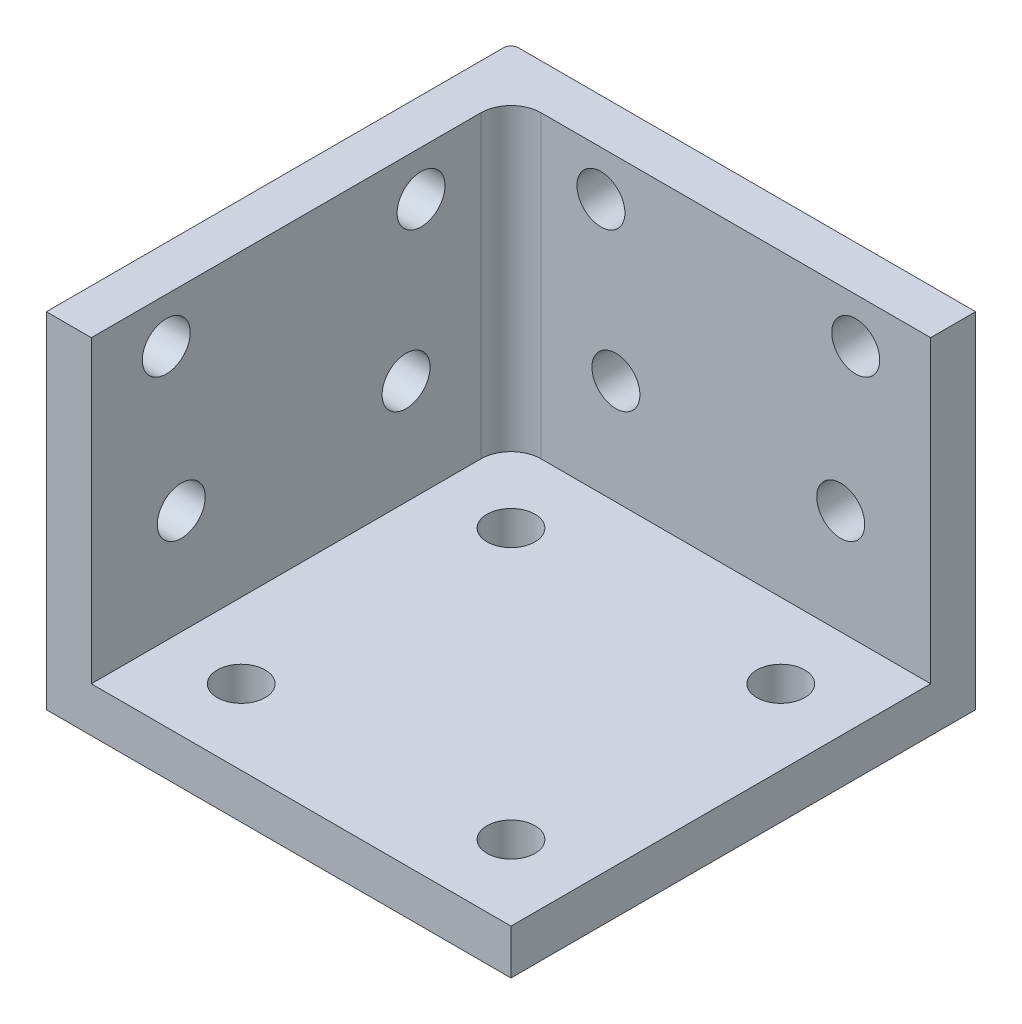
ISO-10303-21;
HEADER;
FILE_DESCRIPTION(('STEP AP214'),'2;1');
FILE_NAME('part.step','',(''),(''),'','','');
FILE_SCHEMA(('AUTOMOTIVE_DESIGN { 1 0 10303 214 1 1 1 1 }'));
ENDSEC;
DATA;
#1=APPLICATION_CONTEXT('core data for automotive mechanical design processes');
#2=APPLICATION_PROTOCOL_DEFINITION('international standard','automotive_design',2000,#1);
#3=PRODUCT_CONTEXT('',#1,'mechanical');
#4=PRODUCT('Part','Part','',(#3));
#5=PRODUCT_RELATED_PRODUCT_CATEGORY('part','',(#4));
#6=PRODUCT_DEFINITION_FORMATION('','',#4);
#7=PRODUCT_DEFINITION_CONTEXT('part definition',#1,'design');
#8=PRODUCT_DEFINITION('design','',#6,#7);
#9=PRODUCT_DEFINITION_SHAPE('','',#8);
#10=(LENGTH_UNIT() NAMED_UNIT(*) SI_UNIT(.MILLI.,.METRE.));
#11=(NAMED_UNIT(*) PLANE_ANGLE_UNIT() SI_UNIT($,.RADIAN.));
#12=(NAMED_UNIT(*) SI_UNIT($,.STERADIAN.) SOLID_ANGLE_UNIT());
#13=UNCERTAINTY_MEASURE_WITH_UNIT(LENGTH_MEASURE(1.E-05),#10,'distance_accuracy_value','');
#14=(GEOMETRIC_REPRESENTATION_CONTEXT(3) GLOBAL_UNCERTAINTY_ASSIGNED_CONTEXT((#13)) GLOBAL_UNIT_ASSIGNED_CONTEXT((#10,
#11,#12)) REPRESENTATION_CONTEXT('',''));
#15=CARTESIAN_POINT('',(0.,0.,0.));
#16=DIRECTION('',(0.,0.,1.));
#17=DIRECTION('',(1.,0.,0.));
#18=AXIS2_PLACEMENT_3D('',#15,#16,#17);
#19=CARTESIAN_POINT('',(0.,0.,28.));
#20=DIRECTION('',(0.,1.,0.));
#21=DIRECTION('',(0.,0.,1.));
#22=AXIS2_PLACEMENT_3D('',#19,#20,#21);
#23=PLANE('',#22);
#24=CARTESIAN_POINT('',(8.,0.,5.));
#25=DIRECTION('',(0.,1.,0.));
#26=DIRECTION('',(0.,0.,1.));
#27=AXIS2_PLACEMENT_3D('',#24,#25,#26);
#28=CIRCLE('',#27,1.6);
#29=CARTESIAN_POINT('',(8.,0.,6.6));
#30=VERTEX_POINT('',#29);
#31=EDGE_CURVE('E365',#30,#30,#28,.T.);
#32=ORIENTED_EDGE('',*,*,#31,.T.);
#33=EDGE_LOOP('',(#32));
#34=FACE_BOUND('',#33,.T.);
#35=CARTESIAN_POINT('',(8.,0.,23.));
#36=DIRECTION('',(0.,1.,0.));
#37=DIRECTION('',(0.,0.,1.));
#38=AXIS2_PLACEMENT_3D('',#35,#36,#37);
#39=CIRCLE('',#38,1.6);
#40=CARTESIAN_POINT('',(8.,0.,24.6));
#41=VERTEX_POINT('',#40);
#42=EDGE_CURVE('E361',#41,#41,#39,.T.);
#43=ORIENTED_EDGE('',*,*,#42,.T.);
#44=EDGE_LOOP('',(#43));
#45=FACE_BOUND('',#44,.T.);
#46=CARTESIAN_POINT('',(26.,0.,5.));
#47=DIRECTION('',(0.,1.,0.));
#48=DIRECTION('',(0.,0.,1.));
#49=AXIS2_PLACEMENT_3D('',#46,#47,#48);
#50=CIRCLE('',#49,1.6);
#51=CARTESIAN_POINT('',(26.,0.,6.6));
#52=VERTEX_POINT('',#51);
#53=EDGE_CURVE('E329',#52,#52,#50,.T.);
#54=ORIENTED_EDGE('',*,*,#53,.T.);
#55=EDGE_LOOP('',(#54));
#56=FACE_BOUND('',#55,.T.);
#57=CARTESIAN_POINT('',(26.,0.,23.));
#58=DIRECTION('',(0.,1.,0.));
#59=DIRECTION('',(0.,0.,1.));
#60=AXIS2_PLACEMENT_3D('',#57,#58,#59);
#61=CIRCLE('',#60,1.6);
#62=CARTESIAN_POINT('',(26.,0.,24.6));
#63=VERTEX_POINT('',#62);
#64=EDGE_CURVE('E328',#63,#63,#61,.T.);
#65=ORIENTED_EDGE('',*,*,#64,.T.);
#66=EDGE_LOOP('',(#65));
#67=FACE_BOUND('',#66,.T.);
#68=DIRECTION('',(0.,0.,-1.));
#69=VECTOR('',#68,1.);
#70=CARTESIAN_POINT('',(0.,0.,28.));
#71=LINE('',#70,#69);
#72=CARTESIAN_POINT('',(0.,0.,28.));
#73=VERTEX_POINT('',#72);
#74=CARTESIAN_POINT('',(0.,0.,-2.5));
#75=VERTEX_POINT('',#74);
#76=EDGE_CURVE('E221',#73,#75,#71,.T.);
#77=ORIENTED_EDGE('',*,*,#76,.T.);
#78=CARTESIAN_POINT('',(0.5,0.,-2.5));
#79=DIRECTION('',(0.,1.,0.));
#80=DIRECTION('',(0.,0.,1.));
#81=AXIS2_PLACEMENT_3D('',#78,#79,#80);
#82=CIRCLE('',#81,0.5);
#83=CARTESIAN_POINT('',(0.5,0.,-3.));
#84=VERTEX_POINT('',#83);
#85=EDGE_CURVE('E11',#75,#84,#82,.F.);
#86=ORIENTED_EDGE('',*,*,#85,.T.);
#87=DIRECTION('',(-1.,0.,0.));
#88=VECTOR('',#87,1.);
#89=CARTESIAN_POINT('',(0.,0.,-3.));
#90=LINE('',#89,#88);
#91=CARTESIAN_POINT('',(31.,0.,-3.));
#92=VERTEX_POINT('',#91);
#93=EDGE_CURVE('E125',#92,#84,#90,.T.);
#94=ORIENTED_EDGE('',*,*,#93,.F.);
#95=DIRECTION('',(0.,0.,-1.));
#96=VECTOR('',#95,1.);
#97=CARTESIAN_POINT('',(31.,0.,28.));
#98=LINE('',#97,#96);
#99=CARTESIAN_POINT('',(31.,0.,28.));
#100=VERTEX_POINT('',#99);
#101=EDGE_CURVE('E129',#100,#92,#98,.T.);
#102=ORIENTED_EDGE('',*,*,#101,.F.);
#103=DIRECTION('',(1.,0.,0.));
#104=VECTOR('',#103,1.);
#105=CARTESIAN_POINT('',(0.,0.,28.));
#106=LINE('',#105,#104);
#107=EDGE_CURVE('E201',#73,#100,#106,.T.);
#108=ORIENTED_EDGE('',*,*,#107,.F.);
#109=EDGE_LOOP('',(#77,#86,#94,#102,#108));
#110=FACE_BOUND('',#109,.T.);
#111=ADVANCED_FACE('F34',(#34,#45,#56,#67,#110),#23,.F.);
#112=CARTESIAN_POINT('',(31.,3.,28.));
#113=DIRECTION('',(-1.,0.,0.));
#114=DIRECTION('',(0.,0.,1.));
#115=AXIS2_PLACEMENT_3D('',#112,#113,#114);
#116=PLANE('',#115);
#117=ORIENTED_EDGE('',*,*,#101,.T.);
#118=DIRECTION('',(0.,-1.,0.));
#119=VECTOR('',#118,1.);
#120=CARTESIAN_POINT('',(31.,0.,-3.));
#121=LINE('',#120,#119);
#122=CARTESIAN_POINT('',(31.,23.,-3.));
#123=VERTEX_POINT('',#122);
#124=EDGE_CURVE('E110',#123,#92,#121,.T.);
#125=ORIENTED_EDGE('',*,*,#124,.F.);
#126=DIRECTION('',(0.,0.,1.));
#127=VECTOR('',#126,1.);
#128=CARTESIAN_POINT('',(31.,23.,-3.));
#129=LINE('',#128,#127);
#130=CARTESIAN_POINT('',(31.,23.,0.));
#131=VERTEX_POINT('',#130);
#132=EDGE_CURVE('E117',#123,#131,#129,.T.);
#133=ORIENTED_EDGE('',*,*,#132,.T.);
#134=DIRECTION('',(0.,-1.,0.));
#135=VECTOR('',#134,1.);
#136=CARTESIAN_POINT('',(31.,0.,0.));
#137=LINE('',#136,#135);
#138=CARTESIAN_POINT('',(31.,3.,0.));
#139=VERTEX_POINT('',#138);
#140=EDGE_CURVE('E114',#131,#139,#137,.T.);
#141=ORIENTED_EDGE('',*,*,#140,.T.);
#142=DIRECTION('',(0.,0.,-1.));
#143=VECTOR('',#142,1.);
#144=CARTESIAN_POINT('',(31.,3.,28.));
#145=LINE('',#144,#143);
#146=CARTESIAN_POINT('',(31.,3.,28.));
#147=VERTEX_POINT('',#146);
#148=EDGE_CURVE('E175',#147,#139,#145,.T.);
#149=ORIENTED_EDGE('',*,*,#148,.F.);
#150=DIRECTION('',(0.,1.,0.));
#151=VECTOR('',#150,1.);
#152=CARTESIAN_POINT('',(31.,3.,28.));
#153=LINE('',#152,#151);
#154=EDGE_CURVE('E207',#100,#147,#153,.T.);
#155=ORIENTED_EDGE('',*,*,#154,.F.);
#156=EDGE_LOOP('',(#117,#125,#133,#141,#149,#155));
#157=FACE_BOUND('',#156,.T.);
#158=ADVANCED_FACE('F127',(#157),#116,.F.);
#159=CARTESIAN_POINT('',(3.,3.,28.));
#160=DIRECTION('',(0.,-1.,0.));
#161=DIRECTION('',(0.,0.,-1.));
#162=AXIS2_PLACEMENT_3D('',#159,#160,#161);
#163=PLANE('',#162);
#164=CARTESIAN_POINT('',(8.,3.,5.));
#165=DIRECTION('',(0.,1.,0.));
#166=DIRECTION('',(0.,0.,1.));
#167=AXIS2_PLACEMENT_3D('',#164,#165,#166);
#168=CIRCLE('',#167,1.6);
#169=CARTESIAN_POINT('',(8.,3.,6.6));
#170=VERTEX_POINT('',#169);
#171=EDGE_CURVE('E124',#170,#170,#168,.T.);
#172=ORIENTED_EDGE('',*,*,#171,.F.);
#173=EDGE_LOOP('',(#172));
#174=FACE_BOUND('',#173,.T.);
#175=CARTESIAN_POINT('',(8.,3.,23.));
#176=DIRECTION('',(0.,1.,0.));
#177=DIRECTION('',(0.,0.,1.));
#178=AXIS2_PLACEMENT_3D('',#175,#176,#177);
#179=CIRCLE('',#178,1.6);
#180=CARTESIAN_POINT('',(8.,3.,24.6));
#181=VERTEX_POINT('',#180);
#182=EDGE_CURVE('E320',#181,#181,#179,.T.);
#183=ORIENTED_EDGE('',*,*,#182,.F.);
#184=EDGE_LOOP('',(#183));
#185=FACE_BOUND('',#184,.T.);
#186=CARTESIAN_POINT('',(26.,3.,5.));
#187=DIRECTION('',(0.,1.,0.));
#188=DIRECTION('',(0.,0.,1.));
#189=AXIS2_PLACEMENT_3D('',#186,#187,#188);
#190=CIRCLE('',#189,1.6);
#191=CARTESIAN_POINT('',(26.,3.,6.6));
#192=VERTEX_POINT('',#191);
#193=EDGE_CURVE('E324',#192,#192,#190,.T.);
#194=ORIENTED_EDGE('',*,*,#193,.F.);
#195=EDGE_LOOP('',(#194));
#196=FACE_BOUND('',#195,.T.);
#197=CARTESIAN_POINT('',(26.,3.,23.));
#198=DIRECTION('',(0.,1.,0.));
#199=DIRECTION('',(0.,0.,1.));
#200=AXIS2_PLACEMENT_3D('',#197,#198,#199);
#201=CIRCLE('',#200,1.6);
#202=CARTESIAN_POINT('',(26.,3.,24.6));
#203=VERTEX_POINT('',#202);
#204=EDGE_CURVE('E327',#203,#203,#201,.T.);
#205=ORIENTED_EDGE('',*,*,#204,.F.);
#206=EDGE_LOOP('',(#205));
#207=FACE_BOUND('',#206,.T.);
#208=DIRECTION('',(-1.,0.,0.));
#209=VECTOR('',#208,1.);
#210=CARTESIAN_POINT('',(3.,3.,0.));
#211=LINE('',#210,#209);
#212=CARTESIAN_POINT('',(5.,3.,0.));
#213=VERTEX_POINT('',#212);
#214=EDGE_CURVE('E171',#139,#213,#211,.T.);
#215=ORIENTED_EDGE('',*,*,#214,.T.);
#216=CARTESIAN_POINT('',(5.,3.,2.));
#217=DIRECTION('',(0.,-1.,0.));
#218=DIRECTION('',(0.,0.,-1.));
#219=AXIS2_PLACEMENT_3D('',#216,#217,#218);
#220=CIRCLE('',#219,2.);
#221=CARTESIAN_POINT('',(3.,3.,2.));
#222=VERTEX_POINT('',#221);
#223=EDGE_CURVE('E145',#213,#222,#220,.F.);
#224=ORIENTED_EDGE('',*,*,#223,.T.);
#225=DIRECTION('',(0.,0.,-1.));
#226=VECTOR('',#225,1.);
#227=CARTESIAN_POINT('',(3.,3.,28.));
#228=LINE('',#227,#226);
#229=CARTESIAN_POINT('',(3.,3.,28.));
#230=VERTEX_POINT('',#229);
#231=EDGE_CURVE('E168',#230,#222,#228,.T.);
#232=ORIENTED_EDGE('',*,*,#231,.F.);
#233=DIRECTION('',(-1.,0.,0.));
#234=VECTOR('',#233,1.);
#235=CARTESIAN_POINT('',(3.,3.,28.));
#236=LINE('',#235,#234);
#237=EDGE_CURVE('E211',#147,#230,#236,.T.);
#238=ORIENTED_EDGE('',*,*,#237,.F.);
#239=ORIENTED_EDGE('',*,*,#148,.T.);
#240=EDGE_LOOP('',(#215,#224,#232,#238,#239));
#241=FACE_BOUND('',#240,.T.);
#242=ADVANCED_FACE('F166',(#174,#185,#196,#207,#241),#163,.F.);
#243=CARTESIAN_POINT('',(3.,3.,28.));
#244=DIRECTION('',(-1.,0.,0.));
#245=DIRECTION('',(0.,0.,1.));
#246=AXIS2_PLACEMENT_3D('',#243,#244,#245);
#247=PLANE('',#246);
#248=CARTESIAN_POINT('',(3.,10.,7.));
#249=DIRECTION('',(1.,0.,0.));
#250=DIRECTION('',(0.,0.,-1.));
#251=AXIS2_PLACEMENT_3D('',#248,#249,#250);
#252=CIRCLE('',#251,1.6);
#253=CARTESIAN_POINT('',(3.,10.,5.4));
#254=VERTEX_POINT('',#253);
#255=EDGE_CURVE('E199',#254,#254,#252,.T.);
#256=ORIENTED_EDGE('',*,*,#255,.F.);
#257=EDGE_LOOP('',(#256));
#258=FACE_BOUND('',#257,.T.);
#259=CARTESIAN_POINT('',(3.,10.,22.));
#260=DIRECTION('',(1.,0.,0.));
#261=DIRECTION('',(0.,0.,-1.));
#262=AXIS2_PLACEMENT_3D('',#259,#260,#261);
#263=CIRCLE('',#262,1.6);
#264=CARTESIAN_POINT('',(3.,10.,20.4));
#265=VERTEX_POINT('',#264);
#266=EDGE_CURVE('E195',#265,#265,#263,.T.);
#267=ORIENTED_EDGE('',*,*,#266,.F.);
#268=EDGE_LOOP('',(#267));
#269=FACE_BOUND('',#268,.T.);
#270=CARTESIAN_POINT('',(3.,20.,6.));
#271=DIRECTION('',(1.,0.,0.));
#272=DIRECTION('',(0.,0.,-1.));
#273=AXIS2_PLACEMENT_3D('',#270,#271,#272);
#274=CIRCLE('',#273,1.6);
#275=CARTESIAN_POINT('',(3.,20.,4.4));
#276=VERTEX_POINT('',#275);
#277=EDGE_CURVE('E191',#276,#276,#274,.T.);
#278=ORIENTED_EDGE('',*,*,#277,.F.);
#279=EDGE_LOOP('',(#278));
#280=FACE_BOUND('',#279,.T.);
#281=CARTESIAN_POINT('',(3.,20.,23.));
#282=DIRECTION('',(1.,0.,0.));
#283=DIRECTION('',(0.,0.,-1.));
#284=AXIS2_PLACEMENT_3D('',#281,#282,#283);
#285=CIRCLE('',#284,1.6);
#286=CARTESIAN_POINT('',(3.,20.,21.4));
#287=VERTEX_POINT('',#286);
#288=EDGE_CURVE('E187',#287,#287,#285,.T.);
#289=ORIENTED_EDGE('',*,*,#288,.F.);
#290=EDGE_LOOP('',(#289));
#291=FACE_BOUND('',#290,.T.);
#292=ORIENTED_EDGE('',*,*,#231,.T.);
#293=DIRECTION('',(0.,1.,0.));
#294=VECTOR('',#293,1.);
#295=CARTESIAN_POINT('',(3.,23.,2.));
#296=LINE('',#295,#294);
#297=CARTESIAN_POINT('',(3.,23.,2.));
#298=VERTEX_POINT('',#297);
#299=EDGE_CURVE('E141',#222,#298,#296,.T.);
#300=ORIENTED_EDGE('',*,*,#299,.T.);
#301=DIRECTION('',(0.,0.,-1.));
#302=VECTOR('',#301,1.);
#303=CARTESIAN_POINT('',(3.,23.,28.));
#304=LINE('',#303,#302);
#305=CARTESIAN_POINT('',(3.,23.,28.));
#306=VERTEX_POINT('',#305);
#307=EDGE_CURVE('E153',#306,#298,#304,.T.);
#308=ORIENTED_EDGE('',*,*,#307,.F.);
#309=DIRECTION('',(0.,1.,0.));
#310=VECTOR('',#309,1.);
#311=CARTESIAN_POINT('',(3.,3.,28.));
#312=LINE('',#311,#310);
#313=EDGE_CURVE('E174',#230,#306,#312,.T.);
#314=ORIENTED_EDGE('',*,*,#313,.F.);
#315=EDGE_LOOP('',(#292,#300,#308,#314));
#316=FACE_BOUND('',#315,.T.);
#317=ADVANCED_FACE('F173',(#258,#269,#280,#291,#316),#247,.F.);
#318=CARTESIAN_POINT('',(0.,23.,28.));
#319=DIRECTION('',(0.,-1.,0.));
#320=DIRECTION('',(0.,0.,-1.));
#321=AXIS2_PLACEMENT_3D('',#318,#319,#320);
#322=PLANE('',#321);
#323=DIRECTION('',(1.,0.,0.));
#324=VECTOR('',#323,1.);
#325=CARTESIAN_POINT('',(0.,23.,-3.));
#326=LINE('',#325,#324);
#327=CARTESIAN_POINT('',(0.5,23.,-3.));
#328=VERTEX_POINT('',#327);
#329=EDGE_CURVE('E105',#328,#123,#326,.T.);
#330=ORIENTED_EDGE('',*,*,#329,.F.);
#331=CARTESIAN_POINT('',(0.5,23.,-2.5));
#332=DIRECTION('',(0.,-1.,0.));
#333=DIRECTION('',(0.,0.,-1.));
#334=AXIS2_PLACEMENT_3D('',#331,#332,#333);
#335=CIRCLE('',#334,0.5);
#336=CARTESIAN_POINT('',(0.,23.,-2.5));
#337=VERTEX_POINT('',#336);
#338=EDGE_CURVE('E56',#328,#337,#335,.F.);
#339=ORIENTED_EDGE('',*,*,#338,.T.);
#340=DIRECTION('',(0.,0.,-1.));
#341=VECTOR('',#340,1.);
#342=CARTESIAN_POINT('',(0.,23.,28.));
#343=LINE('',#342,#341);
#344=CARTESIAN_POINT('',(0.,23.,28.));
#345=VERTEX_POINT('',#344);
#346=EDGE_CURVE('E178',#345,#337,#343,.T.);
#347=ORIENTED_EDGE('',*,*,#346,.F.);
#348=DIRECTION('',(-1.,0.,0.));
#349=VECTOR('',#348,1.);
#350=CARTESIAN_POINT('',(0.,23.,28.));
#351=LINE('',#350,#349);
#352=EDGE_CURVE('E218',#306,#345,#351,.T.);
#353=ORIENTED_EDGE('',*,*,#352,.F.);
#354=ORIENTED_EDGE('',*,*,#307,.T.);
#355=CARTESIAN_POINT('',(5.,23.,2.));
#356=DIRECTION('',(0.,-1.,0.));
#357=DIRECTION('',(0.,0.,-1.));
#358=AXIS2_PLACEMENT_3D('',#355,#356,#357);
#359=CIRCLE('',#358,2.);
#360=CARTESIAN_POINT('',(5.,23.,0.));
#361=VERTEX_POINT('',#360);
#362=EDGE_CURVE('E147',#298,#361,#359,.T.);
#363=ORIENTED_EDGE('',*,*,#362,.T.);
#364=DIRECTION('',(1.,0.,0.));
#365=VECTOR('',#364,1.);
#366=CARTESIAN_POINT('',(0.,23.,0.));
#367=LINE('',#366,#365);
#368=EDGE_CURVE('E120',#361,#131,#367,.T.);
#369=ORIENTED_EDGE('',*,*,#368,.T.);
#370=ORIENTED_EDGE('',*,*,#132,.F.);
#371=EDGE_LOOP('',(#330,#339,#347,#353,#354,#363,#369,#370));
#372=FACE_BOUND('',#371,.T.);
#373=ADVANCED_FACE('F118',(#372),#322,.F.);
#374=CARTESIAN_POINT('',(0.,0.,28.));
#375=DIRECTION('',(1.,0.,0.));
#376=DIRECTION('',(0.,0.,-1.));
#377=AXIS2_PLACEMENT_3D('',#374,#375,#376);
#378=PLANE('',#377);
#379=CARTESIAN_POINT('',(0.,10.,7.));
#380=DIRECTION('',(1.,0.,0.));
#381=DIRECTION('',(0.,0.,-1.));
#382=AXIS2_PLACEMENT_3D('',#379,#380,#381);
#383=CIRCLE('',#382,1.6);
#384=CARTESIAN_POINT('',(0.,10.,5.4));
#385=VERTEX_POINT('',#384);
#386=EDGE_CURVE('E196',#385,#385,#383,.T.);
#387=ORIENTED_EDGE('',*,*,#386,.T.);
#388=EDGE_LOOP('',(#387));
#389=FACE_BOUND('',#388,.T.);
#390=CARTESIAN_POINT('',(0.,10.,22.));
#391=DIRECTION('',(1.,0.,0.));
#392=DIRECTION('',(0.,0.,-1.));
#393=AXIS2_PLACEMENT_3D('',#390,#391,#392);
#394=CIRCLE('',#393,1.6);
#395=CARTESIAN_POINT('',(0.,10.,20.4));
#396=VERTEX_POINT('',#395);
#397=EDGE_CURVE('E192',#396,#396,#394,.T.);
#398=ORIENTED_EDGE('',*,*,#397,.T.);
#399=EDGE_LOOP('',(#398));
#400=FACE_BOUND('',#399,.T.);
#401=CARTESIAN_POINT('',(0.,20.,6.));
#402=DIRECTION('',(1.,0.,0.));
#403=DIRECTION('',(0.,0.,-1.));
#404=AXIS2_PLACEMENT_3D('',#401,#402,#403);
#405=CIRCLE('',#404,1.6);
#406=CARTESIAN_POINT('',(0.,20.,4.4));
#407=VERTEX_POINT('',#406);
#408=EDGE_CURVE('E188',#407,#407,#405,.T.);
#409=ORIENTED_EDGE('',*,*,#408,.T.);
#410=EDGE_LOOP('',(#409));
#411=FACE_BOUND('',#410,.T.);
#412=CARTESIAN_POINT('',(0.,20.,23.));
#413=DIRECTION('',(1.,0.,0.));
#414=DIRECTION('',(0.,0.,-1.));
#415=AXIS2_PLACEMENT_3D('',#412,#413,#414);
#416=CIRCLE('',#415,1.6);
#417=CARTESIAN_POINT('',(0.,20.,21.4));
#418=VERTEX_POINT('',#417);
#419=EDGE_CURVE('E184',#418,#418,#416,.T.);
#420=ORIENTED_EDGE('',*,*,#419,.T.);
#421=EDGE_LOOP('',(#420));
#422=FACE_BOUND('',#421,.T.);
#423=ORIENTED_EDGE('',*,*,#346,.T.);
#424=DIRECTION('',(0.,1.,0.));
#425=VECTOR('',#424,1.);
#426=CARTESIAN_POINT('',(0.,0.,-2.5));
#427=LINE('',#426,#425);
#428=EDGE_CURVE('E42',#337,#75,#427,.F.);
#429=ORIENTED_EDGE('',*,*,#428,.T.);
#430=ORIENTED_EDGE('',*,*,#76,.F.);
#431=DIRECTION('',(0.,-1.,0.));
#432=VECTOR('',#431,1.);
#433=CARTESIAN_POINT('',(0.,0.,28.));
#434=LINE('',#433,#432);
#435=EDGE_CURVE('E220',#345,#73,#434,.T.);
#436=ORIENTED_EDGE('',*,*,#435,.F.);
#437=EDGE_LOOP('',(#423,#429,#430,#436));
#438=FACE_BOUND('',#437,.T.);
#439=ADVANCED_FACE('F225',(#389,#400,#411,#422,#438),#378,.F.);
#440=CARTESIAN_POINT('',(0.,0.,28.));
#441=DIRECTION('',(0.,0.,-1.));
#442=DIRECTION('',(-1.,0.,0.));
#443=AXIS2_PLACEMENT_3D('',#440,#441,#442);
#444=PLANE('',#443);
#445=ORIENTED_EDGE('',*,*,#107,.T.);
#446=ORIENTED_EDGE('',*,*,#154,.T.);
#447=ORIENTED_EDGE('',*,*,#237,.T.);
#448=ORIENTED_EDGE('',*,*,#313,.T.);
#449=ORIENTED_EDGE('',*,*,#352,.T.);
#450=ORIENTED_EDGE('',*,*,#435,.T.);
#451=EDGE_LOOP('',(#445,#446,#447,#448,#449,#450));
#452=FACE_BOUND('',#451,.T.);
#453=ADVANCED_FACE('F299',(#452),#444,.F.);
#454=CARTESIAN_POINT('',(-7.,20.,23.));
#455=DIRECTION('',(1.,0.,0.));
#456=DIRECTION('',(0.,0.,-1.));
#457=AXIS2_PLACEMENT_3D('',#454,#455,#456);
#458=CYLINDRICAL_SURFACE('',#457,1.6);
#459=ORIENTED_EDGE('',*,*,#288,.T.);
#460=EDGE_LOOP('',(#459));
#461=FACE_BOUND('',#460,.T.);
#462=ORIENTED_EDGE('',*,*,#419,.F.);
#463=EDGE_LOOP('',(#462));
#464=FACE_BOUND('',#463,.T.);
#465=ADVANCED_FACE('F295',(#461,#464),#458,.F.);
#466=CARTESIAN_POINT('',(-7.,20.,6.));
#467=DIRECTION('',(1.,0.,0.));
#468=DIRECTION('',(0.,0.,-1.));
#469=AXIS2_PLACEMENT_3D('',#466,#467,#468);
#470=CYLINDRICAL_SURFACE('',#469,1.6);
#471=ORIENTED_EDGE('',*,*,#277,.T.);
#472=EDGE_LOOP('',(#471));
#473=FACE_BOUND('',#472,.T.);
#474=ORIENTED_EDGE('',*,*,#408,.F.);
#475=EDGE_LOOP('',(#474));
#476=FACE_BOUND('',#475,.T.);
#477=ADVANCED_FACE('F291',(#473,#476),#470,.F.);
#478=CARTESIAN_POINT('',(-7.,10.,22.));
#479=DIRECTION('',(1.,0.,0.));
#480=DIRECTION('',(0.,0.,-1.));
#481=AXIS2_PLACEMENT_3D('',#478,#479,#480);
#482=CYLINDRICAL_SURFACE('',#481,1.6);
#483=ORIENTED_EDGE('',*,*,#266,.T.);
#484=EDGE_LOOP('',(#483));
#485=FACE_BOUND('',#484,.T.);
#486=ORIENTED_EDGE('',*,*,#397,.F.);
#487=EDGE_LOOP('',(#486));
#488=FACE_BOUND('',#487,.T.);
#489=ADVANCED_FACE('F287',(#485,#488),#482,.F.);
#490=CARTESIAN_POINT('',(-7.,10.,7.));
#491=DIRECTION('',(1.,0.,0.));
#492=DIRECTION('',(0.,0.,-1.));
#493=AXIS2_PLACEMENT_3D('',#490,#491,#492);
#494=CYLINDRICAL_SURFACE('',#493,1.6);
#495=ORIENTED_EDGE('',*,*,#255,.T.);
#496=EDGE_LOOP('',(#495));
#497=FACE_BOUND('',#496,.T.);
#498=ORIENTED_EDGE('',*,*,#386,.F.);
#499=EDGE_LOOP('',(#498));
#500=FACE_BOUND('',#499,.T.);
#501=ADVANCED_FACE('F283',(#497,#500),#494,.F.);
#502=CARTESIAN_POINT('',(26.,-7.,23.));
#503=DIRECTION('',(0.,1.,0.));
#504=DIRECTION('',(0.,0.,1.));
#505=AXIS2_PLACEMENT_3D('',#502,#503,#504);
#506=CYLINDRICAL_SURFACE('',#505,1.6);
#507=ORIENTED_EDGE('',*,*,#204,.T.);
#508=EDGE_LOOP('',(#507));
#509=FACE_BOUND('',#508,.T.);
#510=ORIENTED_EDGE('',*,*,#64,.F.);
#511=EDGE_LOOP('',(#510));
#512=FACE_BOUND('',#511,.T.);
#513=ADVANCED_FACE('F279',(#509,#512),#506,.F.);
#514=CARTESIAN_POINT('',(26.,-7.,5.));
#515=DIRECTION('',(0.,1.,0.));
#516=DIRECTION('',(0.,0.,1.));
#517=AXIS2_PLACEMENT_3D('',#514,#515,#516);
#518=CYLINDRICAL_SURFACE('',#517,1.6);
#519=ORIENTED_EDGE('',*,*,#193,.T.);
#520=EDGE_LOOP('',(#519));
#521=FACE_BOUND('',#520,.T.);
#522=ORIENTED_EDGE('',*,*,#53,.F.);
#523=EDGE_LOOP('',(#522));
#524=FACE_BOUND('',#523,.T.);
#525=ADVANCED_FACE('F275',(#521,#524),#518,.F.);
#526=CARTESIAN_POINT('',(8.,-7.,23.));
#527=DIRECTION('',(0.,1.,0.));
#528=DIRECTION('',(0.,0.,1.));
#529=AXIS2_PLACEMENT_3D('',#526,#527,#528);
#530=CYLINDRICAL_SURFACE('',#529,1.6);
#531=ORIENTED_EDGE('',*,*,#182,.T.);
#532=EDGE_LOOP('',(#531));
#533=FACE_BOUND('',#532,.T.);
#534=ORIENTED_EDGE('',*,*,#42,.F.);
#535=EDGE_LOOP('',(#534));
#536=FACE_BOUND('',#535,.T.);
#537=ADVANCED_FACE('F271',(#533,#536),#530,.F.);
#538=CARTESIAN_POINT('',(8.,-7.,5.));
#539=DIRECTION('',(0.,1.,0.));
#540=DIRECTION('',(0.,0.,1.));
#541=AXIS2_PLACEMENT_3D('',#538,#539,#540);
#542=CYLINDRICAL_SURFACE('',#541,1.6);
#543=ORIENTED_EDGE('',*,*,#171,.T.);
#544=EDGE_LOOP('',(#543));
#545=FACE_BOUND('',#544,.T.);
#546=ORIENTED_EDGE('',*,*,#31,.F.);
#547=EDGE_LOOP('',(#546));
#548=FACE_BOUND('',#547,.T.);
#549=ADVANCED_FACE('F264',(#545,#548),#542,.F.);
#550=CARTESIAN_POINT('',(0.,0.,-3.));
#551=DIRECTION('',(0.,0.,-1.));
#552=DIRECTION('',(-1.,0.,0.));
#553=AXIS2_PLACEMENT_3D('',#550,#551,#552);
#554=PLANE('',#553);
#555=CARTESIAN_POINT('',(10.,10.,-3.));
#556=DIRECTION('',(0.,0.,1.));
#557=DIRECTION('',(1.,0.,0.));
#558=AXIS2_PLACEMENT_3D('',#555,#556,#557);
#559=CIRCLE('',#558,1.6);
#560=CARTESIAN_POINT('',(11.6,10.,-3.));
#561=VERTEX_POINT('',#560);
#562=EDGE_CURVE('E546',#561,#561,#559,.T.);
#563=ORIENTED_EDGE('',*,*,#562,.T.);
#564=EDGE_LOOP('',(#563));
#565=FACE_BOUND('',#564,.T.);
#566=CARTESIAN_POINT('',(25.,10.,-3.));
#567=DIRECTION('',(0.,0.,1.));
#568=DIRECTION('',(1.,0.,0.));
#569=AXIS2_PLACEMENT_3D('',#566,#567,#568);
#570=CIRCLE('',#569,1.6);
#571=CARTESIAN_POINT('',(26.6,10.,-3.));
#572=VERTEX_POINT('',#571);
#573=EDGE_CURVE('E543',#572,#572,#570,.T.);
#574=ORIENTED_EDGE('',*,*,#573,.T.);
#575=EDGE_LOOP('',(#574));
#576=FACE_BOUND('',#575,.T.);
#577=CARTESIAN_POINT('',(26.,20.,-3.));
#578=DIRECTION('',(0.,0.,1.));
#579=DIRECTION('',(1.,0.,0.));
#580=AXIS2_PLACEMENT_3D('',#577,#578,#579);
#581=CIRCLE('',#580,1.6);
#582=CARTESIAN_POINT('',(27.6,20.,-3.));
#583=VERTEX_POINT('',#582);
#584=EDGE_CURVE('E537',#583,#583,#581,.T.);
#585=ORIENTED_EDGE('',*,*,#584,.T.);
#586=EDGE_LOOP('',(#585));
#587=FACE_BOUND('',#586,.T.);
#588=CARTESIAN_POINT('',(9.,20.,-3.));
#589=DIRECTION('',(0.,0.,1.));
#590=DIRECTION('',(1.,0.,0.));
#591=AXIS2_PLACEMENT_3D('',#588,#589,#590);
#592=CIRCLE('',#591,1.6);
#593=CARTESIAN_POINT('',(10.6,20.,-3.));
#594=VERTEX_POINT('',#593);
#595=EDGE_CURVE('E140',#594,#594,#592,.T.);
#596=ORIENTED_EDGE('',*,*,#595,.T.);
#597=EDGE_LOOP('',(#596));
#598=FACE_BOUND('',#597,.T.);
#599=ORIENTED_EDGE('',*,*,#93,.T.);
#600=DIRECTION('',(0.,1.,0.));
#601=VECTOR('',#600,1.);
#602=CARTESIAN_POINT('',(0.5,23.,-3.));
#603=LINE('',#602,#601);
#604=EDGE_CURVE('E113',#84,#328,#603,.T.);
#605=ORIENTED_EDGE('',*,*,#604,.T.);
#606=ORIENTED_EDGE('',*,*,#329,.T.);
#607=ORIENTED_EDGE('',*,*,#124,.T.);
#608=EDGE_LOOP('',(#599,#605,#606,#607));
#609=FACE_BOUND('',#608,.T.);
#610=ADVANCED_FACE('F108',(#565,#576,#587,#598,#609),#554,.T.);
#611=CARTESIAN_POINT('',(0.,0.,0.));
#612=DIRECTION('',(0.,0.,-1.));
#613=DIRECTION('',(-1.,0.,0.));
#614=AXIS2_PLACEMENT_3D('',#611,#612,#613);
#615=PLANE('',#614);
#616=CARTESIAN_POINT('',(10.,10.,0.));
#617=DIRECTION('',(0.,0.,1.));
#618=DIRECTION('',(1.,0.,0.));
#619=AXIS2_PLACEMENT_3D('',#616,#617,#618);
#620=CIRCLE('',#619,1.6);
#621=CARTESIAN_POINT('',(11.6,10.,0.));
#622=VERTEX_POINT('',#621);
#623=EDGE_CURVE('E524',#622,#622,#620,.T.);
#624=ORIENTED_EDGE('',*,*,#623,.F.);
#625=EDGE_LOOP('',(#624));
#626=FACE_BOUND('',#625,.T.);
#627=CARTESIAN_POINT('',(25.,10.,0.));
#628=DIRECTION('',(0.,0.,1.));
#629=DIRECTION('',(1.,0.,0.));
#630=AXIS2_PLACEMENT_3D('',#627,#628,#629);
#631=CIRCLE('',#630,1.6);
#632=CARTESIAN_POINT('',(26.6,10.,0.));
#633=VERTEX_POINT('',#632);
#634=EDGE_CURVE('E528',#633,#633,#631,.T.);
#635=ORIENTED_EDGE('',*,*,#634,.F.);
#636=EDGE_LOOP('',(#635));
#637=FACE_BOUND('',#636,.T.);
#638=CARTESIAN_POINT('',(26.,20.,0.));
#639=DIRECTION('',(0.,0.,1.));
#640=DIRECTION('',(1.,0.,0.));
#641=AXIS2_PLACEMENT_3D('',#638,#639,#640);
#642=CIRCLE('',#641,1.6);
#643=CARTESIAN_POINT('',(27.6,20.,0.));
#644=VERTEX_POINT('',#643);
#645=EDGE_CURVE('E532',#644,#644,#642,.T.);
#646=ORIENTED_EDGE('',*,*,#645,.F.);
#647=EDGE_LOOP('',(#646));
#648=FACE_BOUND('',#647,.T.);
#649=CARTESIAN_POINT('',(9.,20.,0.));
#650=DIRECTION('',(0.,0.,1.));
#651=DIRECTION('',(1.,0.,0.));
#652=AXIS2_PLACEMENT_3D('',#649,#650,#651);
#653=CIRCLE('',#652,1.6);
#654=CARTESIAN_POINT('',(10.6,20.,0.));
#655=VERTEX_POINT('',#654);
#656=EDGE_CURVE('E535',#655,#655,#653,.T.);
#657=ORIENTED_EDGE('',*,*,#656,.F.);
#658=EDGE_LOOP('',(#657));
#659=FACE_BOUND('',#658,.T.);
#660=ORIENTED_EDGE('',*,*,#368,.F.);
#661=DIRECTION('',(0.,1.,0.));
#662=VECTOR('',#661,1.);
#663=CARTESIAN_POINT('',(5.,3.,0.));
#664=LINE('',#663,#662);
#665=EDGE_CURVE('E143',#361,#213,#664,.F.);
#666=ORIENTED_EDGE('',*,*,#665,.T.);
#667=ORIENTED_EDGE('',*,*,#214,.F.);
#668=ORIENTED_EDGE('',*,*,#140,.F.);
#669=EDGE_LOOP('',(#660,#666,#667,#668));
#670=FACE_BOUND('',#669,.T.);
#671=ADVANCED_FACE('F159',(#626,#637,#648,#659,#670),#615,.F.);
#672=CARTESIAN_POINT('',(9.,20.,-3.));
#673=DIRECTION('',(0.,0.,1.));
#674=DIRECTION('',(1.,0.,0.));
#675=AXIS2_PLACEMENT_3D('',#672,#673,#674);
#676=CYLINDRICAL_SURFACE('',#675,1.6);
#677=ORIENTED_EDGE('',*,*,#595,.F.);
#678=EDGE_LOOP('',(#677));
#679=FACE_BOUND('',#678,.T.);
#680=ORIENTED_EDGE('',*,*,#656,.T.);
#681=EDGE_LOOP('',(#680));
#682=FACE_BOUND('',#681,.T.);
#683=ADVANCED_FACE('F257',(#679,#682),#676,.F.);
#684=CARTESIAN_POINT('',(26.,20.,-3.));
#685=DIRECTION('',(0.,0.,1.));
#686=DIRECTION('',(1.,0.,0.));
#687=AXIS2_PLACEMENT_3D('',#684,#685,#686);
#688=CYLINDRICAL_SURFACE('',#687,1.6);
#689=ORIENTED_EDGE('',*,*,#584,.F.);
#690=EDGE_LOOP('',(#689));
#691=FACE_BOUND('',#690,.T.);
#692=ORIENTED_EDGE('',*,*,#645,.T.);
#693=EDGE_LOOP('',(#692));
#694=FACE_BOUND('',#693,.T.);
#695=ADVANCED_FACE('F249',(#691,#694),#688,.F.);
#696=CARTESIAN_POINT('',(25.,10.,-3.));
#697=DIRECTION('',(0.,0.,1.));
#698=DIRECTION('',(1.,0.,0.));
#699=AXIS2_PLACEMENT_3D('',#696,#697,#698);
#700=CYLINDRICAL_SURFACE('',#699,1.6);
#701=ORIENTED_EDGE('',*,*,#573,.F.);
#702=EDGE_LOOP('',(#701));
#703=FACE_BOUND('',#702,.T.);
#704=ORIENTED_EDGE('',*,*,#634,.T.);
#705=EDGE_LOOP('',(#704));
#706=FACE_BOUND('',#705,.T.);
#707=ADVANCED_FACE('F243',(#703,#706),#700,.F.);
#708=CARTESIAN_POINT('',(10.,10.,-3.));
#709=DIRECTION('',(0.,0.,1.));
#710=DIRECTION('',(1.,0.,0.));
#711=AXIS2_PLACEMENT_3D('',#708,#709,#710);
#712=CYLINDRICAL_SURFACE('',#711,1.6);
#713=ORIENTED_EDGE('',*,*,#562,.F.);
#714=EDGE_LOOP('',(#713));
#715=FACE_BOUND('',#714,.T.);
#716=ORIENTED_EDGE('',*,*,#623,.T.);
#717=EDGE_LOOP('',(#716));
#718=FACE_BOUND('',#717,.T.);
#719=ADVANCED_FACE('F238',(#715,#718),#712,.F.);
#720=CARTESIAN_POINT('',(5.,3.,2.));
#721=DIRECTION('',(0.,-1.,0.));
#722=DIRECTION('',(0.,0.,-1.));
#723=AXIS2_PLACEMENT_3D('',#720,#721,#722);
#724=CYLINDRICAL_SURFACE('',#723,2.);
#725=ORIENTED_EDGE('',*,*,#223,.F.);
#726=ORIENTED_EDGE('',*,*,#665,.F.);
#727=ORIENTED_EDGE('',*,*,#362,.F.);
#728=ORIENTED_EDGE('',*,*,#299,.F.);
#729=EDGE_LOOP('',(#725,#726,#727,#728));
#730=FACE_BOUND('',#729,.T.);
#731=ADVANCED_FACE('F162',(#730),#724,.F.);
#732=CARTESIAN_POINT('',(0.5,0.,-2.5));
#733=DIRECTION('',(0.,-1.,0.));
#734=DIRECTION('',(0.,0.,-1.));
#735=AXIS2_PLACEMENT_3D('',#732,#733,#734);
#736=CYLINDRICAL_SURFACE('',#735,0.5);
#737=ORIENTED_EDGE('',*,*,#85,.F.);
#738=ORIENTED_EDGE('',*,*,#428,.F.);
#739=ORIENTED_EDGE('',*,*,#338,.F.);
#740=ORIENTED_EDGE('',*,*,#604,.F.);
#741=EDGE_LOOP('',(#737,#738,#739,#740));
#742=FACE_BOUND('',#741,.T.);
#743=ADVANCED_FACE('F36',(#742),#736,.T.);
#744=CLOSED_SHELL('',(#111,#158,#242,#317,#373,#439,#453,#465,#477,#489,#501,#513,#525,#537,
#549,#610,#671,#683,#695,#707,#719,#731,#743));
#745=MANIFOLD_SOLID_BREP('B2',#744);
#746=ADVANCED_BREP_SHAPE_REPRESENTATION('',(#18,#745),#14);
#747=SHAPE_DEFINITION_REPRESENTATION(#9,#746);
ENDSEC;
END-ISO-10303-21;
